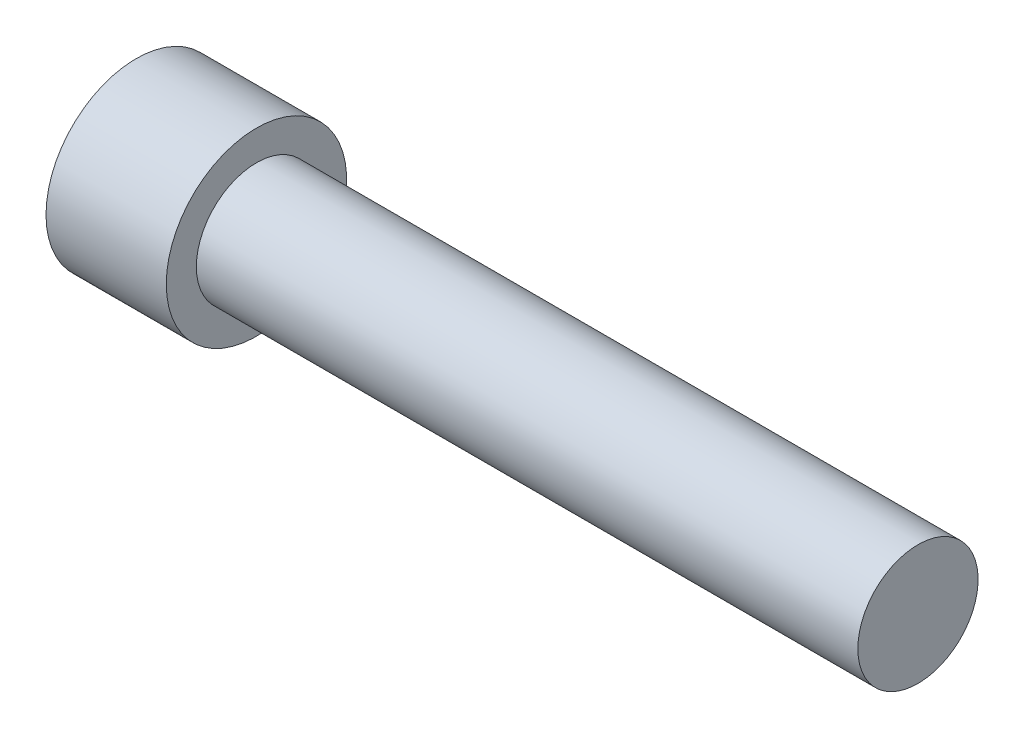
ISO-10303-21;
HEADER;
FILE_DESCRIPTION(('STEP AP214'),'2;1');
FILE_NAME('part.step','',(''),(''),'','','');
FILE_SCHEMA(('AUTOMOTIVE_DESIGN { 1 0 10303 214 1 1 1 1 }'));
ENDSEC;
DATA;
#1=APPLICATION_CONTEXT('core data for automotive mechanical design processes');
#2=APPLICATION_PROTOCOL_DEFINITION('international standard','automotive_design',2000,#1);
#3=PRODUCT_CONTEXT('',#1,'mechanical');
#4=PRODUCT('Part','Part','',(#3));
#5=PRODUCT_RELATED_PRODUCT_CATEGORY('part','',(#4));
#6=PRODUCT_DEFINITION_FORMATION('','',#4);
#7=PRODUCT_DEFINITION_CONTEXT('part definition',#1,'design');
#8=PRODUCT_DEFINITION('design','',#6,#7);
#9=PRODUCT_DEFINITION_SHAPE('','',#8);
#10=(LENGTH_UNIT() NAMED_UNIT(*) SI_UNIT(.MILLI.,.METRE.));
#11=(NAMED_UNIT(*) PLANE_ANGLE_UNIT() SI_UNIT($,.RADIAN.));
#12=(NAMED_UNIT(*) SI_UNIT($,.STERADIAN.) SOLID_ANGLE_UNIT());
#13=UNCERTAINTY_MEASURE_WITH_UNIT(LENGTH_MEASURE(1.E-05),#10,'distance_accuracy_value','');
#14=(GEOMETRIC_REPRESENTATION_CONTEXT(3) GLOBAL_UNCERTAINTY_ASSIGNED_CONTEXT((#13)) GLOBAL_UNIT_ASSIGNED_CONTEXT((#10,
#11,#12)) REPRESENTATION_CONTEXT('',''));
#15=CARTESIAN_POINT('',(0.,0.,0.));
#16=DIRECTION('',(0.,0.,1.));
#17=DIRECTION('',(1.,0.,0.));
#18=AXIS2_PLACEMENT_3D('',#15,#16,#17);
#19=CARTESIAN_POINT('',(-31.6838382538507,-2.,0.));
#20=DIRECTION('',(1.,0.,0.));
#21=DIRECTION('',(0.,0.,-1.));
#22=AXIS2_PLACEMENT_3D('',#19,#20,#21);
#23=PLANE('',#22);
#24=DIRECTION('',(0.,0.036001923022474,-0.999351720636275));
#25=VECTOR('',#24,1.);
#26=CARTESIAN_POINT('',(-31.6838382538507,-0.276718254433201,1.10869247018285));
#27=LINE('',#26,#25);
#28=CARTESIAN_POINT('',(-31.6838382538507,-0.276718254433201,1.10869247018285));
#29=VERTEX_POINT('',#28);
#30=CARTESIAN_POINT('',(-31.6838382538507,-0.201528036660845,-0.978459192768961));
#31=VERTEX_POINT('',#30);
#32=EDGE_CURVE('E120',#29,#31,#27,.T.);
#33=ORIENTED_EDGE('',*,*,#32,.F.);
#34=DIRECTION('',(0.,0.883464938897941,-0.468497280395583));
#35=VECTOR('',#34,1.);
#36=CARTESIAN_POINT('',(-31.6838382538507,-2.12183972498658,2.08715166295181));
#37=LINE('',#36,#35);
#38=CARTESIAN_POINT('',(-31.6838382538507,-2.12183972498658,2.08715166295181));
#39=VERTEX_POINT('',#38);
#40=EDGE_CURVE('E46',#39,#29,#37,.T.);
#41=ORIENTED_EDGE('',*,*,#40,.F.);
#42=DIRECTION('',(0.,0.847463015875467,0.530854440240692));
#43=VECTOR('',#42,1.);
#44=CARTESIAN_POINT('',(-31.6838382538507,-3.89177097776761,0.978459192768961));
#45=LINE('',#44,#43);
#46=CARTESIAN_POINT('',(-31.6838382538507,-3.89177097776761,0.978459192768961));
#47=VERTEX_POINT('',#46);
#48=EDGE_CURVE('E129',#47,#39,#45,.T.);
#49=ORIENTED_EDGE('',*,*,#48,.F.);
#50=DIRECTION('',(0.,-0.036001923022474,0.999351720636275));
#51=VECTOR('',#50,1.);
#52=CARTESIAN_POINT('',(-31.6838382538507,-3.81658075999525,-1.10869247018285));
#53=LINE('',#52,#51);
#54=CARTESIAN_POINT('',(-31.6838382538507,-3.81658075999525,-1.10869247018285));
#55=VERTEX_POINT('',#54);
#56=EDGE_CURVE('E127',#55,#47,#53,.T.);
#57=ORIENTED_EDGE('',*,*,#56,.F.);
#58=DIRECTION('',(0.,-0.883464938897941,0.468497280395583));
#59=VECTOR('',#58,1.);
#60=CARTESIAN_POINT('',(-31.6838382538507,-1.97145928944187,-2.08715166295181));
#61=LINE('',#60,#59);
#62=CARTESIAN_POINT('',(-31.6838382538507,-1.97145928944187,-2.08715166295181));
#63=VERTEX_POINT('',#62);
#64=EDGE_CURVE('E94',#63,#55,#61,.T.);
#65=ORIENTED_EDGE('',*,*,#64,.F.);
#66=DIRECTION('',(0.,-0.847463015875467,-0.530854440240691));
#67=VECTOR('',#66,1.);
#68=CARTESIAN_POINT('',(-31.6838382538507,-0.201528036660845,-0.978459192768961));
#69=LINE('',#68,#67);
#70=EDGE_CURVE('E123',#31,#63,#69,.T.);
#71=ORIENTED_EDGE('',*,*,#70,.F.);
#72=EDGE_LOOP('',(#33,#41,#49,#57,#65,#71));
#73=FACE_BOUND('',#72,.T.);
#74=CARTESIAN_POINT('',(-31.6838382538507,-2.,0.));
#75=DIRECTION('',(-1.,0.,0.));
#76=DIRECTION('',(0.,0.,1.));
#77=AXIS2_PLACEMENT_3D('',#74,#75,#76);
#78=CIRCLE('',#77,3.);
#79=CARTESIAN_POINT('',(-31.6838382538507,-2.,3.));
#80=VERTEX_POINT('',#79);
#81=EDGE_CURVE('E11',#80,#80,#78,.T.);
#82=ORIENTED_EDGE('',*,*,#81,.T.);
#83=EDGE_LOOP('',(#82));
#84=FACE_BOUND('',#83,.T.);
#85=ADVANCED_FACE('F32',(#73,#84),#23,.F.);
#86=CARTESIAN_POINT('',(-31.6838382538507,-2.,0.));
#87=DIRECTION('',(-1.,0.,0.));
#88=DIRECTION('',(0.,0.,1.));
#89=AXIS2_PLACEMENT_3D('',#86,#87,#88);
#90=CYLINDRICAL_SURFACE('',#89,3.);
#91=ORIENTED_EDGE('',*,*,#81,.F.);
#92=EDGE_LOOP('',(#91));
#93=FACE_BOUND('',#92,.T.);
#94=CARTESIAN_POINT('',(-27.6838382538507,-2.,0.));
#95=DIRECTION('',(-1.,0.,0.));
#96=DIRECTION('',(0.,0.,1.));
#97=AXIS2_PLACEMENT_3D('',#94,#95,#96);
#98=CIRCLE('',#97,3.);
#99=CARTESIAN_POINT('',(-27.6838382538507,-2.,3.));
#100=VERTEX_POINT('',#99);
#101=EDGE_CURVE('E39',#100,#100,#98,.T.);
#102=ORIENTED_EDGE('',*,*,#101,.T.);
#103=EDGE_LOOP('',(#102));
#104=FACE_BOUND('',#103,.T.);
#105=ADVANCED_FACE('F146',(#93,#104),#90,.T.);
#106=CARTESIAN_POINT('',(-27.6838382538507,1.,0.));
#107=DIRECTION('',(-1.,0.,0.));
#108=DIRECTION('',(0.,0.,1.));
#109=AXIS2_PLACEMENT_3D('',#106,#107,#108);
#110=PLANE('',#109);
#111=ORIENTED_EDGE('',*,*,#101,.F.);
#112=EDGE_LOOP('',(#111));
#113=FACE_BOUND('',#112,.T.);
#114=CARTESIAN_POINT('',(-27.6838382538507,-2.,0.));
#115=DIRECTION('',(-1.,0.,0.));
#116=DIRECTION('',(0.,0.,1.));
#117=AXIS2_PLACEMENT_3D('',#114,#115,#116);
#118=CIRCLE('',#117,2.);
#119=CARTESIAN_POINT('',(-27.6838382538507,-2.,2.));
#120=VERTEX_POINT('',#119);
#121=EDGE_CURVE('E141',#120,#120,#118,.T.);
#122=ORIENTED_EDGE('',*,*,#121,.T.);
#123=EDGE_LOOP('',(#122));
#124=FACE_BOUND('',#123,.T.);
#125=ADVANCED_FACE('F148',(#113,#124),#110,.F.);
#126=CARTESIAN_POINT('',(-31.6838382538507,-2.,0.));
#127=DIRECTION('',(-1.,0.,0.));
#128=DIRECTION('',(0.,0.,1.));
#129=AXIS2_PLACEMENT_3D('',#126,#127,#128);
#130=CYLINDRICAL_SURFACE('',#129,2.);
#131=ORIENTED_EDGE('',*,*,#121,.F.);
#132=EDGE_LOOP('',(#131));
#133=FACE_BOUND('',#132,.T.);
#134=CARTESIAN_POINT('',(-5.68383825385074,-2.,0.));
#135=DIRECTION('',(-1.,0.,0.));
#136=DIRECTION('',(0.,0.,1.));
#137=AXIS2_PLACEMENT_3D('',#134,#135,#136);
#138=CIRCLE('',#137,2.);
#139=CARTESIAN_POINT('',(-5.68383825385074,-2.,2.));
#140=VERTEX_POINT('',#139);
#141=EDGE_CURVE('E133',#140,#140,#138,.T.);
#142=ORIENTED_EDGE('',*,*,#141,.T.);
#143=EDGE_LOOP('',(#142));
#144=FACE_BOUND('',#143,.T.);
#145=ADVANCED_FACE('F151',(#133,#144),#130,.T.);
#146=CARTESIAN_POINT('',(-5.68383825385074,0.,0.));
#147=DIRECTION('',(-1.,0.,0.));
#148=DIRECTION('',(0.,0.,1.));
#149=AXIS2_PLACEMENT_3D('',#146,#147,#148);
#150=PLANE('',#149);
#151=ORIENTED_EDGE('',*,*,#141,.F.);
#152=EDGE_LOOP('',(#151));
#153=FACE_BOUND('',#152,.T.);
#154=ADVANCED_FACE('F157',(#153),#150,.F.);
#155=CARTESIAN_POINT('',(-28.6838382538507,-2.12183972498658,2.08715166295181));
#156=DIRECTION('',(0.,0.468497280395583,0.883464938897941));
#157=DIRECTION('',(0.,-0.883464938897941,0.468497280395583));
#158=AXIS2_PLACEMENT_3D('',#155,#156,#157);
#159=PLANE('',#158);
#160=ORIENTED_EDGE('',*,*,#40,.T.);
#161=DIRECTION('',(-1.,0.,0.));
#162=VECTOR('',#161,1.);
#163=CARTESIAN_POINT('',(-28.6838382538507,-0.276718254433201,1.10869247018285));
#164=LINE('',#163,#162);
#165=CARTESIAN_POINT('',(-28.6838382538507,-0.276718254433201,1.10869247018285));
#166=VERTEX_POINT('',#165);
#167=EDGE_CURVE('E76',#166,#29,#164,.T.);
#168=ORIENTED_EDGE('',*,*,#167,.F.);
#169=DIRECTION('',(0.,0.883464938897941,-0.468497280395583));
#170=VECTOR('',#169,1.);
#171=CARTESIAN_POINT('',(-28.6838382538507,-2.12183972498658,2.08715166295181));
#172=LINE('',#171,#170);
#173=CARTESIAN_POINT('',(-28.6838382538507,-2.12183972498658,2.08715166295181));
#174=VERTEX_POINT('',#173);
#175=EDGE_CURVE('E131',#174,#166,#172,.T.);
#176=ORIENTED_EDGE('',*,*,#175,.F.);
#177=DIRECTION('',(-1.,0.,0.));
#178=VECTOR('',#177,1.);
#179=CARTESIAN_POINT('',(-28.6838382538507,-2.12183972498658,2.08715166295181));
#180=LINE('',#179,#178);
#181=EDGE_CURVE('E54',#174,#39,#180,.T.);
#182=ORIENTED_EDGE('',*,*,#181,.T.);
#183=EDGE_LOOP('',(#160,#168,#176,#182));
#184=FACE_BOUND('',#183,.T.);
#185=ADVANCED_FACE('F162',(#184),#159,.F.);
#186=CARTESIAN_POINT('',(-28.6838382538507,-3.89177097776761,0.978459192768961));
#187=DIRECTION('',(0.,-0.530854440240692,0.847463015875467));
#188=DIRECTION('',(0.,-0.847463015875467,-0.530854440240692));
#189=AXIS2_PLACEMENT_3D('',#186,#187,#188);
#190=PLANE('',#189);
#191=ORIENTED_EDGE('',*,*,#48,.T.);
#192=ORIENTED_EDGE('',*,*,#181,.F.);
#193=DIRECTION('',(0.,0.847463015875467,0.530854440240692));
#194=VECTOR('',#193,1.);
#195=CARTESIAN_POINT('',(-28.6838382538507,-3.89177097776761,0.978459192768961));
#196=LINE('',#195,#194);
#197=CARTESIAN_POINT('',(-28.6838382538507,-3.89177097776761,0.978459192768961));
#198=VERTEX_POINT('',#197);
#199=EDGE_CURVE('E106',#198,#174,#196,.T.);
#200=ORIENTED_EDGE('',*,*,#199,.F.);
#201=DIRECTION('',(-1.,0.,0.));
#202=VECTOR('',#201,1.);
#203=CARTESIAN_POINT('',(-28.6838382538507,-3.89177097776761,0.978459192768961));
#204=LINE('',#203,#202);
#205=EDGE_CURVE('E98',#198,#47,#204,.T.);
#206=ORIENTED_EDGE('',*,*,#205,.T.);
#207=EDGE_LOOP('',(#191,#192,#200,#206));
#208=FACE_BOUND('',#207,.T.);
#209=ADVANCED_FACE('F167',(#208),#190,.F.);
#210=CARTESIAN_POINT('',(-28.6838382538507,-3.81658075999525,-1.10869247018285));
#211=DIRECTION('',(0.,-0.999351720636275,-0.036001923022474));
#212=DIRECTION('',(0.,0.036001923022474,-0.999351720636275));
#213=AXIS2_PLACEMENT_3D('',#210,#211,#212);
#214=PLANE('',#213);
#215=ORIENTED_EDGE('',*,*,#56,.T.);
#216=ORIENTED_EDGE('',*,*,#205,.F.);
#217=DIRECTION('',(0.,-0.036001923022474,0.999351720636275));
#218=VECTOR('',#217,1.);
#219=CARTESIAN_POINT('',(-28.6838382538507,-3.81658075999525,-1.10869247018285));
#220=LINE('',#219,#218);
#221=CARTESIAN_POINT('',(-28.6838382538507,-3.81658075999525,-1.10869247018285));
#222=VERTEX_POINT('',#221);
#223=EDGE_CURVE('E102',#222,#198,#220,.T.);
#224=ORIENTED_EDGE('',*,*,#223,.F.);
#225=DIRECTION('',(-1.,0.,0.));
#226=VECTOR('',#225,1.);
#227=CARTESIAN_POINT('',(-28.6838382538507,-3.81658075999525,-1.10869247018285));
#228=LINE('',#227,#226);
#229=EDGE_CURVE('E87',#222,#55,#228,.T.);
#230=ORIENTED_EDGE('',*,*,#229,.T.);
#231=EDGE_LOOP('',(#215,#216,#224,#230));
#232=FACE_BOUND('',#231,.T.);
#233=ADVANCED_FACE('F103',(#232),#214,.F.);
#234=CARTESIAN_POINT('',(-28.6838382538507,-1.97145928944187,-2.08715166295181));
#235=DIRECTION('',(0.,-0.468497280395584,-0.883464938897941));
#236=DIRECTION('',(0.,0.883464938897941,-0.468497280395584));
#237=AXIS2_PLACEMENT_3D('',#234,#235,#236);
#238=PLANE('',#237);
#239=ORIENTED_EDGE('',*,*,#64,.T.);
#240=ORIENTED_EDGE('',*,*,#229,.F.);
#241=DIRECTION('',(0.,-0.883464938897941,0.468497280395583));
#242=VECTOR('',#241,1.);
#243=CARTESIAN_POINT('',(-28.6838382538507,-1.97145928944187,-2.08715166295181));
#244=LINE('',#243,#242);
#245=CARTESIAN_POINT('',(-28.6838382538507,-1.97145928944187,-2.08715166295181));
#246=VERTEX_POINT('',#245);
#247=EDGE_CURVE('E91',#246,#222,#244,.T.);
#248=ORIENTED_EDGE('',*,*,#247,.F.);
#249=DIRECTION('',(-1.,0.,0.));
#250=VECTOR('',#249,1.);
#251=CARTESIAN_POINT('',(-28.6838382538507,-1.97145928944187,-2.08715166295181));
#252=LINE('',#251,#250);
#253=EDGE_CURVE('E99',#246,#63,#252,.T.);
#254=ORIENTED_EDGE('',*,*,#253,.T.);
#255=EDGE_LOOP('',(#239,#240,#248,#254));
#256=FACE_BOUND('',#255,.T.);
#257=ADVANCED_FACE('F89',(#256),#238,.F.);
#258=CARTESIAN_POINT('',(-28.6838382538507,-0.201528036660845,-0.978459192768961));
#259=DIRECTION('',(0.,0.530854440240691,-0.847463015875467));
#260=DIRECTION('',(0.,0.847463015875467,0.530854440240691));
#261=AXIS2_PLACEMENT_3D('',#258,#259,#260);
#262=PLANE('',#261);
#263=ORIENTED_EDGE('',*,*,#70,.T.);
#264=ORIENTED_EDGE('',*,*,#253,.F.);
#265=DIRECTION('',(0.,-0.847463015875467,-0.530854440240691));
#266=VECTOR('',#265,1.);
#267=CARTESIAN_POINT('',(-28.6838382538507,-0.201528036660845,-0.978459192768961));
#268=LINE('',#267,#266);
#269=CARTESIAN_POINT('',(-28.6838382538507,-0.201528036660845,-0.978459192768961));
#270=VERTEX_POINT('',#269);
#271=EDGE_CURVE('E112',#270,#246,#268,.T.);
#272=ORIENTED_EDGE('',*,*,#271,.F.);
#273=DIRECTION('',(-1.,0.,0.));
#274=VECTOR('',#273,1.);
#275=CARTESIAN_POINT('',(-28.6838382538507,-0.201528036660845,-0.978459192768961));
#276=LINE('',#275,#274);
#277=EDGE_CURVE('E136',#270,#31,#276,.T.);
#278=ORIENTED_EDGE('',*,*,#277,.T.);
#279=EDGE_LOOP('',(#263,#264,#272,#278));
#280=FACE_BOUND('',#279,.T.);
#281=ADVANCED_FACE('F193',(#280),#262,.F.);
#282=CARTESIAN_POINT('',(-28.6838382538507,-0.276718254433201,1.10869247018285));
#283=DIRECTION('',(0.,0.999351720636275,0.036001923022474));
#284=DIRECTION('',(0.,-0.036001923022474,0.999351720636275));
#285=AXIS2_PLACEMENT_3D('',#282,#283,#284);
#286=PLANE('',#285);
#287=ORIENTED_EDGE('',*,*,#32,.T.);
#288=ORIENTED_EDGE('',*,*,#277,.F.);
#289=DIRECTION('',(0.,0.036001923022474,-0.999351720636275));
#290=VECTOR('',#289,1.);
#291=CARTESIAN_POINT('',(-28.6838382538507,-0.276718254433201,1.10869247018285));
#292=LINE('',#291,#290);
#293=EDGE_CURVE('E114',#166,#270,#292,.T.);
#294=ORIENTED_EDGE('',*,*,#293,.F.);
#295=ORIENTED_EDGE('',*,*,#167,.T.);
#296=EDGE_LOOP('',(#287,#288,#294,#295));
#297=FACE_BOUND('',#296,.T.);
#298=ADVANCED_FACE('F181',(#297),#286,.F.);
#299=CARTESIAN_POINT('',(-28.6838382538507,0.,0.));
#300=DIRECTION('',(-1.,0.,0.));
#301=DIRECTION('',(0.,0.,1.));
#302=AXIS2_PLACEMENT_3D('',#299,#300,#301);
#303=PLANE('',#302);
#304=ORIENTED_EDGE('',*,*,#175,.T.);
#305=ORIENTED_EDGE('',*,*,#293,.T.);
#306=ORIENTED_EDGE('',*,*,#271,.T.);
#307=ORIENTED_EDGE('',*,*,#247,.T.);
#308=ORIENTED_EDGE('',*,*,#223,.T.);
#309=ORIENTED_EDGE('',*,*,#199,.T.);
#310=EDGE_LOOP('',(#304,#305,#306,#307,#308,#309));
#311=FACE_BOUND('',#310,.T.);
#312=ADVANCED_FACE('F109',(#311),#303,.T.);
#313=CLOSED_SHELL('',(#85,#105,#125,#145,#154,#185,#209,#233,#257,#281,#298,#312));
#314=MANIFOLD_SOLID_BREP('B2',#313);
#315=ADVANCED_BREP_SHAPE_REPRESENTATION('',(#18,#314),#14);
#316=SHAPE_DEFINITION_REPRESENTATION(#9,#315);
ENDSEC;
END-ISO-10303-21;
